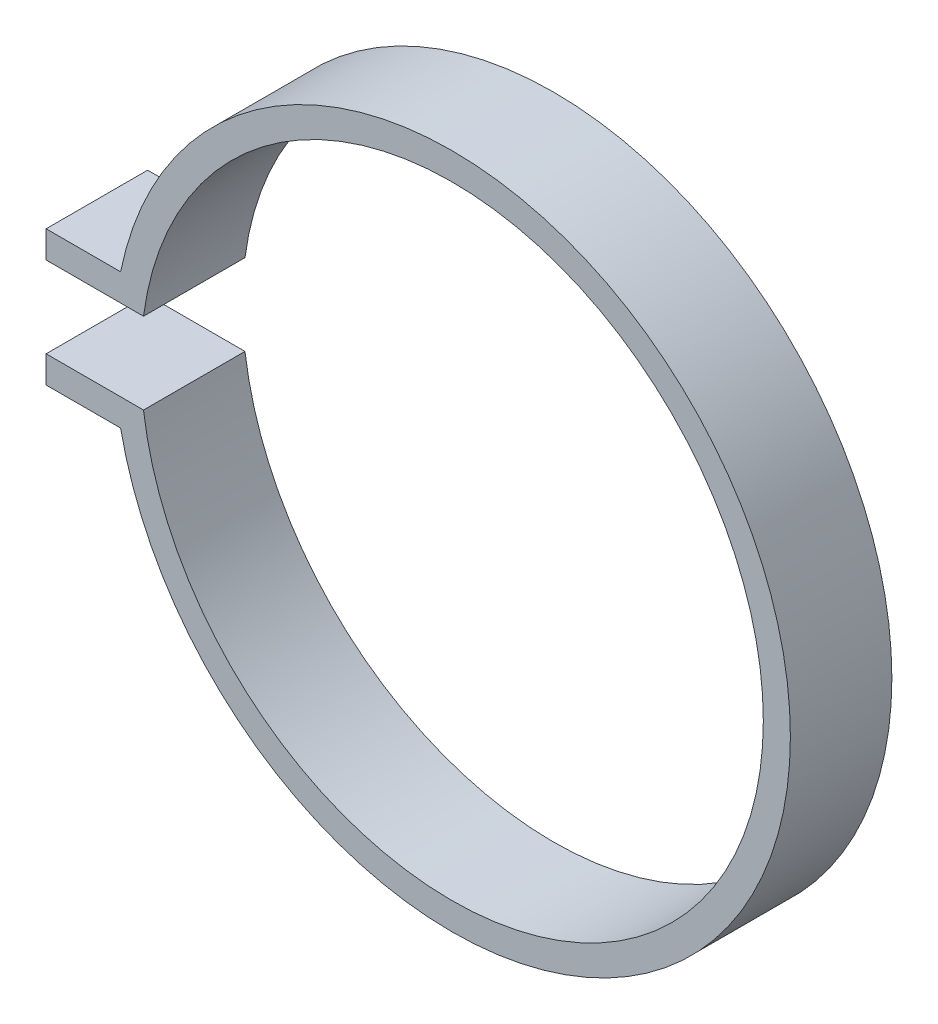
ISO-10303-21;
HEADER;
FILE_DESCRIPTION(('STEP AP214'),'2;1');
FILE_NAME('part.step','',(''),(''),'','','');
FILE_SCHEMA(('AUTOMOTIVE_DESIGN { 1 0 10303 214 1 1 1 1 }'));
ENDSEC;
DATA;
#1=APPLICATION_CONTEXT('core data for automotive mechanical design processes');
#2=APPLICATION_PROTOCOL_DEFINITION('international standard','automotive_design',2000,#1);
#3=PRODUCT_CONTEXT('',#1,'mechanical');
#4=PRODUCT('Part','Part','',(#3));
#5=PRODUCT_RELATED_PRODUCT_CATEGORY('part','',(#4));
#6=PRODUCT_DEFINITION_FORMATION('','',#4);
#7=PRODUCT_DEFINITION_CONTEXT('part definition',#1,'design');
#8=PRODUCT_DEFINITION('design','',#6,#7);
#9=PRODUCT_DEFINITION_SHAPE('','',#8);
#10=(LENGTH_UNIT() NAMED_UNIT(*) SI_UNIT(.MILLI.,.METRE.));
#11=(NAMED_UNIT(*) PLANE_ANGLE_UNIT() SI_UNIT($,.RADIAN.));
#12=(NAMED_UNIT(*) SI_UNIT($,.STERADIAN.) SOLID_ANGLE_UNIT());
#13=UNCERTAINTY_MEASURE_WITH_UNIT(LENGTH_MEASURE(1.E-05),#10,'distance_accuracy_value','');
#14=(GEOMETRIC_REPRESENTATION_CONTEXT(3) GLOBAL_UNCERTAINTY_ASSIGNED_CONTEXT((#13)) GLOBAL_UNIT_ASSIGNED_CONTEXT((#10,
#11,#12)) REPRESENTATION_CONTEXT('',''));
#15=CARTESIAN_POINT('',(0.,0.,0.));
#16=DIRECTION('',(0.,0.,1.));
#17=DIRECTION('',(1.,0.,0.));
#18=AXIS2_PLACEMENT_3D('',#15,#16,#17);
#19=CARTESIAN_POINT('',(0.,0.,15.));
#20=DIRECTION('',(0.,0.,-1.));
#21=DIRECTION('',(-1.,0.,0.));
#22=AXIS2_PLACEMENT_3D('',#19,#20,#21);
#23=CYLINDRICAL_SURFACE('',#22,50.);
#24=CARTESIAN_POINT('',(0.,0.,0.));
#25=DIRECTION('',(0.,0.,1.));
#26=DIRECTION('',(1.,0.,0.));
#27=AXIS2_PLACEMENT_3D('',#24,#25,#26);
#28=CIRCLE('',#27,50.);
#29=CARTESIAN_POINT('',(-48.9897948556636,-10.,0.));
#30=VERTEX_POINT('',#29);
#31=CARTESIAN_POINT('',(-48.9897948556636,10.,0.));
#32=VERTEX_POINT('',#31);
#33=EDGE_CURVE('E142',#30,#32,#28,.T.);
#34=ORIENTED_EDGE('',*,*,#33,.T.);
#35=DIRECTION('',(0.,0.,-1.));
#36=VECTOR('',#35,1.);
#37=CARTESIAN_POINT('',(-48.9897948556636,10.,15.));
#38=LINE('',#37,#36);
#39=CARTESIAN_POINT('',(-48.9897948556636,10.,15.));
#40=VERTEX_POINT('',#39);
#41=EDGE_CURVE('E11',#40,#32,#38,.T.);
#42=ORIENTED_EDGE('',*,*,#41,.F.);
#43=CARTESIAN_POINT('',(0.,0.,15.));
#44=DIRECTION('',(0.,0.,1.));
#45=DIRECTION('',(1.,0.,0.));
#46=AXIS2_PLACEMENT_3D('',#43,#44,#45);
#47=CIRCLE('',#46,50.);
#48=CARTESIAN_POINT('',(-48.9897948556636,-10.,15.));
#49=VERTEX_POINT('',#48);
#50=EDGE_CURVE('E164',#49,#40,#47,.T.);
#51=ORIENTED_EDGE('',*,*,#50,.F.);
#52=DIRECTION('',(0.,0.,-1.));
#53=VECTOR('',#52,1.);
#54=CARTESIAN_POINT('',(-48.9897948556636,-10.,15.));
#55=LINE('',#54,#53);
#56=EDGE_CURVE('E138',#49,#30,#55,.T.);
#57=ORIENTED_EDGE('',*,*,#56,.T.);
#58=EDGE_LOOP('',(#34,#42,#51,#57));
#59=FACE_BOUND('',#58,.T.);
#60=ADVANCED_FACE('F40',(#59),#23,.T.);
#61=CARTESIAN_POINT('',(-60.,10.,15.));
#62=DIRECTION('',(0.,-1.,0.));
#63=DIRECTION('',(0.,0.,-1.));
#64=AXIS2_PLACEMENT_3D('',#61,#62,#63);
#65=PLANE('',#64);
#66=DIRECTION('',(-1.,0.,0.));
#67=VECTOR('',#66,1.);
#68=CARTESIAN_POINT('',(-60.,10.,0.));
#69=LINE('',#68,#67);
#70=CARTESIAN_POINT('',(-60.,10.,0.));
#71=VERTEX_POINT('',#70);
#72=EDGE_CURVE('E146',#32,#71,#69,.T.);
#73=ORIENTED_EDGE('',*,*,#72,.T.);
#74=DIRECTION('',(0.,0.,-1.));
#75=VECTOR('',#74,1.);
#76=CARTESIAN_POINT('',(-60.,10.,15.));
#77=LINE('',#76,#75);
#78=CARTESIAN_POINT('',(-60.,10.,15.));
#79=VERTEX_POINT('',#78);
#80=EDGE_CURVE('E49',#79,#71,#77,.T.);
#81=ORIENTED_EDGE('',*,*,#80,.F.);
#82=DIRECTION('',(-1.,0.,0.));
#83=VECTOR('',#82,1.);
#84=CARTESIAN_POINT('',(-60.,10.,15.));
#85=LINE('',#84,#83);
#86=EDGE_CURVE('E100',#40,#79,#85,.T.);
#87=ORIENTED_EDGE('',*,*,#86,.F.);
#88=ORIENTED_EDGE('',*,*,#41,.T.);
#89=EDGE_LOOP('',(#73,#81,#87,#88));
#90=FACE_BOUND('',#89,.T.);
#91=ADVANCED_FACE('F213',(#90),#65,.F.);
#92=CARTESIAN_POINT('',(-60.,10.,15.));
#93=DIRECTION('',(1.,0.,0.));
#94=DIRECTION('',(0.,0.,-1.));
#95=AXIS2_PLACEMENT_3D('',#92,#93,#94);
#96=PLANE('',#95);
#97=DIRECTION('',(0.,-1.,0.));
#98=VECTOR('',#97,1.);
#99=CARTESIAN_POINT('',(-60.,10.,0.));
#100=LINE('',#99,#98);
#101=CARTESIAN_POINT('',(-60.,6.,0.));
#102=VERTEX_POINT('',#101);
#103=EDGE_CURVE('E149',#71,#102,#100,.T.);
#104=ORIENTED_EDGE('',*,*,#103,.T.);
#105=DIRECTION('',(0.,0.,-1.));
#106=VECTOR('',#105,1.);
#107=CARTESIAN_POINT('',(-60.,6.,15.));
#108=LINE('',#107,#106);
#109=CARTESIAN_POINT('',(-60.,6.,15.));
#110=VERTEX_POINT('',#109);
#111=EDGE_CURVE('E175',#110,#102,#108,.T.);
#112=ORIENTED_EDGE('',*,*,#111,.F.);
#113=DIRECTION('',(0.,-1.,0.));
#114=VECTOR('',#113,1.);
#115=CARTESIAN_POINT('',(-60.,10.,15.));
#116=LINE('',#115,#114);
#117=EDGE_CURVE('E186',#79,#110,#116,.T.);
#118=ORIENTED_EDGE('',*,*,#117,.F.);
#119=ORIENTED_EDGE('',*,*,#80,.T.);
#120=EDGE_LOOP('',(#104,#112,#118,#119));
#121=FACE_BOUND('',#120,.T.);
#122=ADVANCED_FACE('F184',(#121),#96,.F.);
#123=CARTESIAN_POINT('',(-60.,6.,15.));
#124=DIRECTION('',(0.,1.,0.));
#125=DIRECTION('',(0.,0.,1.));
#126=AXIS2_PLACEMENT_3D('',#123,#124,#125);
#127=PLANE('',#126);
#128=DIRECTION('',(1.,0.,0.));
#129=VECTOR('',#128,1.);
#130=CARTESIAN_POINT('',(-60.,6.,0.));
#131=LINE('',#130,#129);
#132=CARTESIAN_POINT('',(-45.6070170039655,6.,0.));
#133=VERTEX_POINT('',#132);
#134=EDGE_CURVE('E152',#102,#133,#131,.T.);
#135=ORIENTED_EDGE('',*,*,#134,.T.);
#136=DIRECTION('',(0.,0.,-1.));
#137=VECTOR('',#136,1.);
#138=CARTESIAN_POINT('',(-45.6070170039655,6.,15.));
#139=LINE('',#138,#137);
#140=CARTESIAN_POINT('',(-45.6070170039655,6.,15.));
#141=VERTEX_POINT('',#140);
#142=EDGE_CURVE('E171',#141,#133,#139,.T.);
#143=ORIENTED_EDGE('',*,*,#142,.F.);
#144=DIRECTION('',(1.,0.,0.));
#145=VECTOR('',#144,1.);
#146=CARTESIAN_POINT('',(-60.,6.,15.));
#147=LINE('',#146,#145);
#148=EDGE_CURVE('E199',#110,#141,#147,.T.);
#149=ORIENTED_EDGE('',*,*,#148,.F.);
#150=ORIENTED_EDGE('',*,*,#111,.T.);
#151=EDGE_LOOP('',(#135,#143,#149,#150));
#152=FACE_BOUND('',#151,.T.);
#153=ADVANCED_FACE('F194',(#152),#127,.F.);
#154=CARTESIAN_POINT('',(0.,0.,15.));
#155=DIRECTION('',(0.,0.,-1.));
#156=DIRECTION('',(-1.,0.,0.));
#157=AXIS2_PLACEMENT_3D('',#154,#155,#156);
#158=CYLINDRICAL_SURFACE('',#157,46.);
#159=CARTESIAN_POINT('',(0.,0.,0.));
#160=DIRECTION('',(0.,0.,-1.));
#161=DIRECTION('',(1.,0.,0.));
#162=AXIS2_PLACEMENT_3D('',#159,#160,#161);
#163=CIRCLE('',#162,46.);
#164=CARTESIAN_POINT('',(-45.6070170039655,-5.99999999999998,0.));
#165=VERTEX_POINT('',#164);
#166=EDGE_CURVE('E155',#133,#165,#163,.T.);
#167=ORIENTED_EDGE('',*,*,#166,.T.);
#168=DIRECTION('',(0.,0.,-1.));
#169=VECTOR('',#168,1.);
#170=CARTESIAN_POINT('',(-45.6070170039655,-5.99999999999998,15.));
#171=LINE('',#170,#169);
#172=CARTESIAN_POINT('',(-45.6070170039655,-5.99999999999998,15.));
#173=VERTEX_POINT('',#172);
#174=EDGE_CURVE('E130',#173,#165,#171,.T.);
#175=ORIENTED_EDGE('',*,*,#174,.F.);
#176=CARTESIAN_POINT('',(0.,0.,15.));
#177=DIRECTION('',(0.,0.,-1.));
#178=DIRECTION('',(1.,0.,0.));
#179=AXIS2_PLACEMENT_3D('',#176,#177,#178);
#180=CIRCLE('',#179,46.);
#181=EDGE_CURVE('E119',#141,#173,#180,.T.);
#182=ORIENTED_EDGE('',*,*,#181,.F.);
#183=ORIENTED_EDGE('',*,*,#142,.T.);
#184=EDGE_LOOP('',(#167,#175,#182,#183));
#185=FACE_BOUND('',#184,.T.);
#186=ADVANCED_FACE('F197',(#185),#158,.F.);
#187=CARTESIAN_POINT('',(-60.,-6.,15.));
#188=DIRECTION('',(0.,-1.,0.));
#189=DIRECTION('',(0.,0.,-1.));
#190=AXIS2_PLACEMENT_3D('',#187,#188,#189);
#191=PLANE('',#190);
#192=DIRECTION('',(-1.,0.,0.));
#193=VECTOR('',#192,1.);
#194=CARTESIAN_POINT('',(-60.,-6.,0.));
#195=LINE('',#194,#193);
#196=CARTESIAN_POINT('',(-60.,-6.,0.));
#197=VERTEX_POINT('',#196);
#198=EDGE_CURVE('E128',#165,#197,#195,.T.);
#199=ORIENTED_EDGE('',*,*,#198,.T.);
#200=DIRECTION('',(0.,0.,-1.));
#201=VECTOR('',#200,1.);
#202=CARTESIAN_POINT('',(-60.,-6.,15.));
#203=LINE('',#202,#201);
#204=CARTESIAN_POINT('',(-60.,-6.,15.));
#205=VERTEX_POINT('',#204);
#206=EDGE_CURVE('E125',#205,#197,#203,.T.);
#207=ORIENTED_EDGE('',*,*,#206,.F.);
#208=DIRECTION('',(-1.,0.,0.));
#209=VECTOR('',#208,1.);
#210=CARTESIAN_POINT('',(-60.,-6.,15.));
#211=LINE('',#210,#209);
#212=EDGE_CURVE('E113',#173,#205,#211,.T.);
#213=ORIENTED_EDGE('',*,*,#212,.F.);
#214=ORIENTED_EDGE('',*,*,#174,.T.);
#215=EDGE_LOOP('',(#199,#207,#213,#214));
#216=FACE_BOUND('',#215,.T.);
#217=ADVANCED_FACE('F126',(#216),#191,.F.);
#218=CARTESIAN_POINT('',(-60.,-6.,15.));
#219=DIRECTION('',(1.,0.,0.));
#220=DIRECTION('',(0.,0.,-1.));
#221=AXIS2_PLACEMENT_3D('',#218,#219,#220);
#222=PLANE('',#221);
#223=DIRECTION('',(0.,-1.,0.));
#224=VECTOR('',#223,1.);
#225=CARTESIAN_POINT('',(-60.,-6.,0.));
#226=LINE('',#225,#224);
#227=CARTESIAN_POINT('',(-60.,-10.,0.));
#228=VERTEX_POINT('',#227);
#229=EDGE_CURVE('E86',#197,#228,#226,.T.);
#230=ORIENTED_EDGE('',*,*,#229,.T.);
#231=DIRECTION('',(0.,0.,-1.));
#232=VECTOR('',#231,1.);
#233=CARTESIAN_POINT('',(-60.,-10.,15.));
#234=LINE('',#233,#232);
#235=CARTESIAN_POINT('',(-60.,-10.,15.));
#236=VERTEX_POINT('',#235);
#237=EDGE_CURVE('E131',#236,#228,#234,.T.);
#238=ORIENTED_EDGE('',*,*,#237,.F.);
#239=DIRECTION('',(0.,-1.,0.));
#240=VECTOR('',#239,1.);
#241=CARTESIAN_POINT('',(-60.,-6.,15.));
#242=LINE('',#241,#240);
#243=EDGE_CURVE('E117',#205,#236,#242,.T.);
#244=ORIENTED_EDGE('',*,*,#243,.F.);
#245=ORIENTED_EDGE('',*,*,#206,.T.);
#246=EDGE_LOOP('',(#230,#238,#244,#245));
#247=FACE_BOUND('',#246,.T.);
#248=ADVANCED_FACE('F133',(#247),#222,.F.);
#249=CARTESIAN_POINT('',(-60.,-10.,15.));
#250=DIRECTION('',(0.,1.,0.));
#251=DIRECTION('',(0.,0.,1.));
#252=AXIS2_PLACEMENT_3D('',#249,#250,#251);
#253=PLANE('',#252);
#254=DIRECTION('',(1.,0.,0.));
#255=VECTOR('',#254,1.);
#256=CARTESIAN_POINT('',(-60.,-10.,0.));
#257=LINE('',#256,#255);
#258=EDGE_CURVE('E92',#228,#30,#257,.T.);
#259=ORIENTED_EDGE('',*,*,#258,.T.);
#260=ORIENTED_EDGE('',*,*,#56,.F.);
#261=DIRECTION('',(1.,0.,0.));
#262=VECTOR('',#261,1.);
#263=CARTESIAN_POINT('',(-60.,-10.,15.));
#264=LINE('',#263,#262);
#265=EDGE_CURVE('E57',#236,#49,#264,.T.);
#266=ORIENTED_EDGE('',*,*,#265,.F.);
#267=ORIENTED_EDGE('',*,*,#237,.T.);
#268=EDGE_LOOP('',(#259,#260,#266,#267));
#269=FACE_BOUND('',#268,.T.);
#270=ADVANCED_FACE('F229',(#269),#253,.F.);
#271=CARTESIAN_POINT('',(0.,0.,15.));
#272=DIRECTION('',(0.,0.,1.));
#273=DIRECTION('',(1.,0.,0.));
#274=AXIS2_PLACEMENT_3D('',#271,#272,#273);
#275=PLANE('',#274);
#276=ORIENTED_EDGE('',*,*,#50,.T.);
#277=ORIENTED_EDGE('',*,*,#86,.T.);
#278=ORIENTED_EDGE('',*,*,#117,.T.);
#279=ORIENTED_EDGE('',*,*,#148,.T.);
#280=ORIENTED_EDGE('',*,*,#181,.T.);
#281=ORIENTED_EDGE('',*,*,#212,.T.);
#282=ORIENTED_EDGE('',*,*,#243,.T.);
#283=ORIENTED_EDGE('',*,*,#265,.T.);
#284=EDGE_LOOP('',(#276,#277,#278,#279,#280,#281,#282,#283));
#285=FACE_BOUND('',#284,.T.);
#286=ADVANCED_FACE('F115',(#285),#275,.T.);
#287=CARTESIAN_POINT('',(0.,0.,0.));
#288=DIRECTION('',(0.,0.,1.));
#289=DIRECTION('',(1.,0.,0.));
#290=AXIS2_PLACEMENT_3D('',#287,#288,#289);
#291=PLANE('',#290);
#292=ORIENTED_EDGE('',*,*,#33,.F.);
#293=ORIENTED_EDGE('',*,*,#258,.F.);
#294=ORIENTED_EDGE('',*,*,#229,.F.);
#295=ORIENTED_EDGE('',*,*,#198,.F.);
#296=ORIENTED_EDGE('',*,*,#166,.F.);
#297=ORIENTED_EDGE('',*,*,#134,.F.);
#298=ORIENTED_EDGE('',*,*,#103,.F.);
#299=ORIENTED_EDGE('',*,*,#72,.F.);
#300=EDGE_LOOP('',(#292,#293,#294,#295,#296,#297,#298,#299));
#301=FACE_BOUND('',#300,.T.);
#302=ADVANCED_FACE('F190',(#301),#291,.F.);
#303=CLOSED_SHELL('',(#60,#91,#122,#153,#186,#217,#248,#270,#286,#302));
#304=MANIFOLD_SOLID_BREP('B2',#303);
#305=ADVANCED_BREP_SHAPE_REPRESENTATION('',(#18,#304),#14);
#306=SHAPE_DEFINITION_REPRESENTATION(#9,#305);
ENDSEC;
END-ISO-10303-21;
